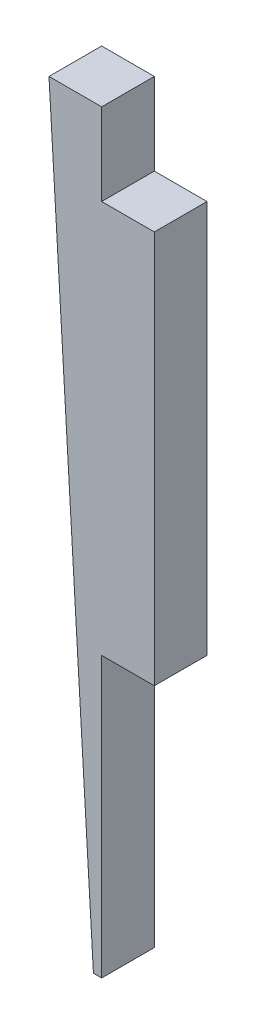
from build123d import *

# Parameters (mm, degrees)
BOSS_EXTRUDE1_DEPTH = 1.524


with BuildPart() as part:
    # Sketch1 → Boss-Extrude1 (new body)
    with BuildSketch(Plane.XY):
        Polygon((-1.524, -3.769451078), (0, -3.769451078), (0, 7.600945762), (-1.524, 7.600945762), (-1.524, 9.973108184), (-3.048, 9.973108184), (-1.761793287, -11.852606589), (-1.524, -11.852606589), align=None)
    extrude(amount=BOSS_EXTRUDE1_DEPTH)


solid = part.part
